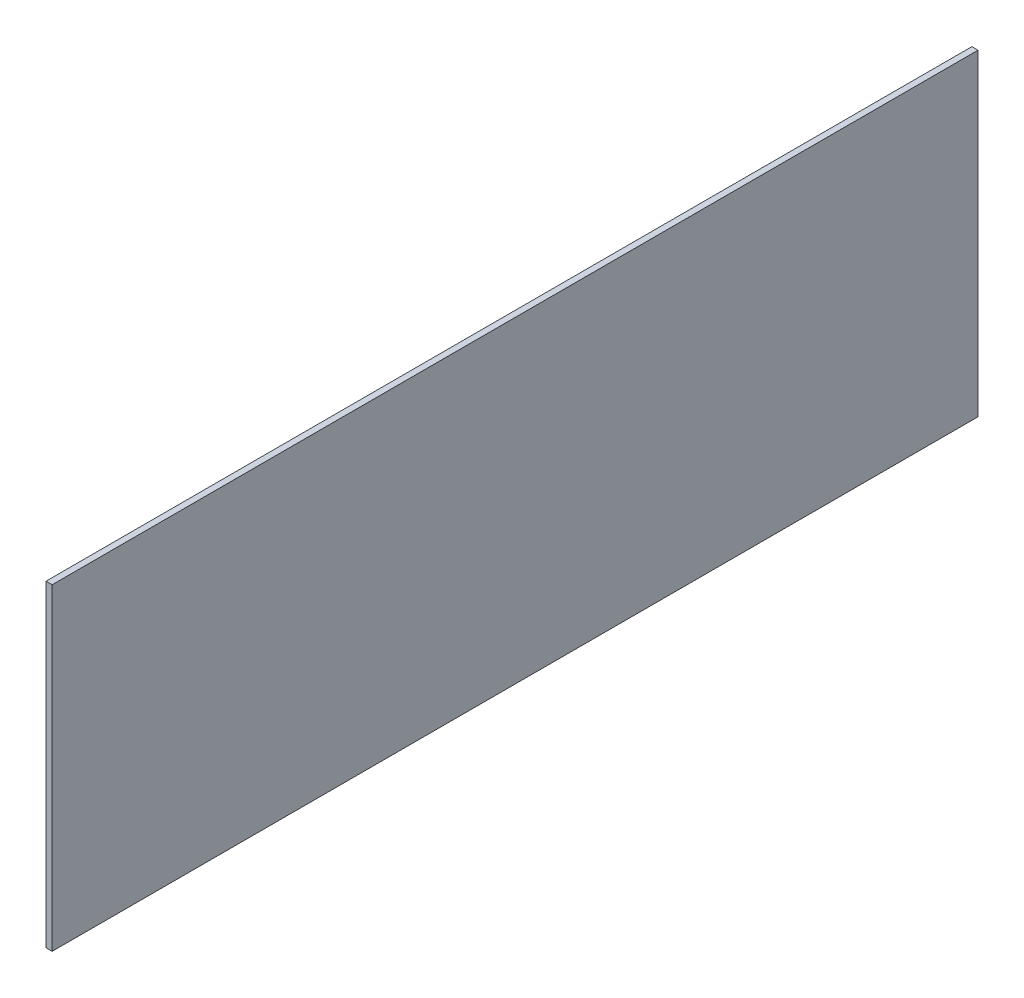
from build123d import *

# Parameters (mm, degrees)
SKETCH1_W           = 452
SKETCH1_H           = 155
BOSS_EXTRUDE1_DEPTH = 3


with BuildPart() as part:
    # Sketch1 → Boss-Extrude1 (new body)
    with BuildSketch(Plane(origin=(0, 0, 0), x_dir=(0, 0, -1), z_dir=(1, 0, 0))):
        with Locations((226, 77.5)):
            Rectangle(SKETCH1_W, SKETCH1_H)
    extrude(amount=BOSS_EXTRUDE1_DEPTH)


solid = part.part
